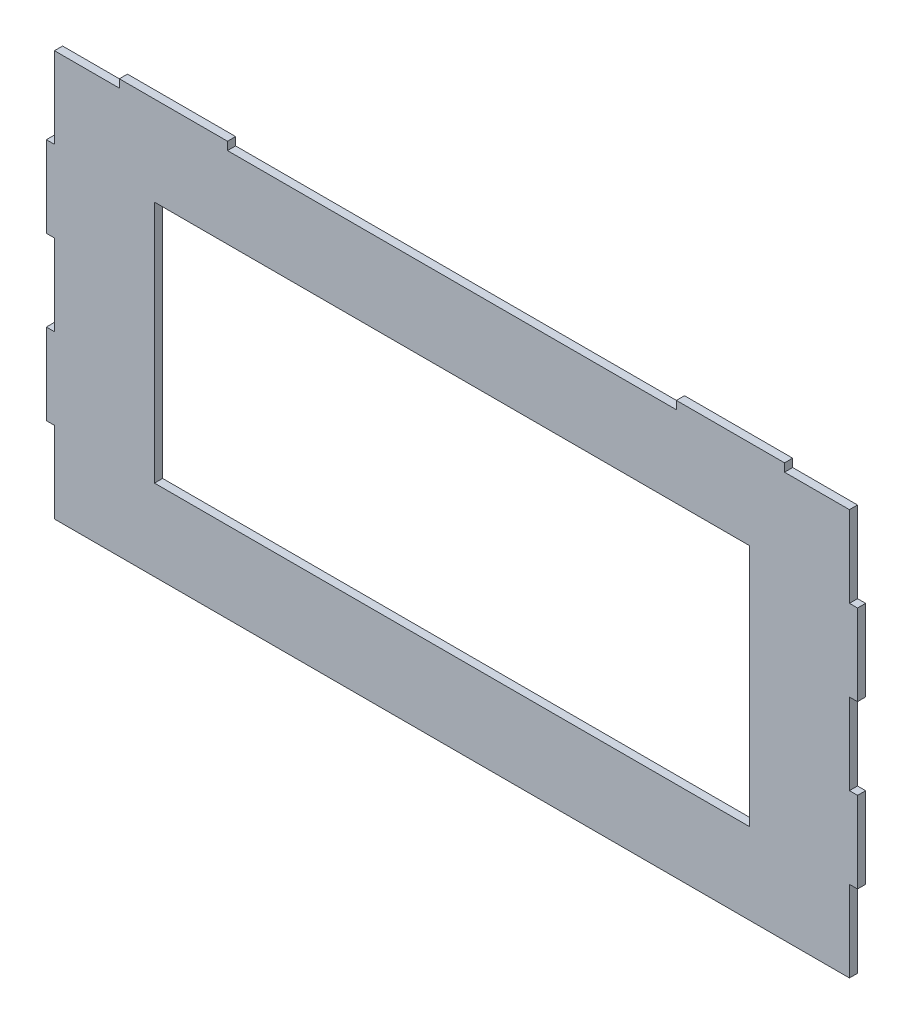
from build123d import *

# Parameters (mm, degrees)
CROQUIS1_W              = 294
CROQUIS1_H              = 150
CROQUIS1_W_2            = 220
CROQUIS1_H_2            = 90
SALIENTE_EXTRUIR1_DEPTH = 3
CROQUIS2_W              = 40
CROQUIS2_H              = 3
SALIENTE_EXTRUIR2_DEPTH = 3
CROQUIS3_W              = 3
CROQUIS3_H              = 30
SALIENTE_EXTRUIR3_DEPTH = 3
CROQUIS4_W              = 3
CROQUIS4_H              = 30
SALIENTE_EXTRUIR4_DEPTH = 3


with BuildPart() as part:
    # Croquis1 → Saliente-Extruir1 (new body)
    with BuildSketch(Plane.XY):
        Rectangle(CROQUIS1_W, CROQUIS1_H)
        Rectangle(CROQUIS1_W_2, CROQUIS1_H_2, mode=Mode.SUBTRACT)
    extrude(amount=SALIENTE_EXTRUIR1_DEPTH)

    # Croquis2 → Saliente-Extruir2 (add)
    with BuildSketch(Plane(origin=(0, 75, 0), x_dir=(1, 0, 0), z_dir=(0, 1, 0))):
        with Locations((-103, -1.5)):
            Rectangle(CROQUIS2_W, CROQUIS2_H)
        with Locations((103, -1.5)):
            Rectangle(CROQUIS2_W, CROQUIS2_H)
    extrude(amount=SALIENTE_EXTRUIR2_DEPTH)

    # Croquis3 → Saliente-Extruir3 (add)
    with BuildSketch(Plane(origin=(147, 0, 0), x_dir=(0, 0, -1), z_dir=(1, 0, 0))):
        with Locations((-1.5, 30)):
            Rectangle(CROQUIS3_W, CROQUIS3_H)
        with Locations((-1.5, -30)):
            Rectangle(CROQUIS3_W, CROQUIS3_H)
    extrude(amount=SALIENTE_EXTRUIR3_DEPTH)

    # Croquis4 → Saliente-Extruir4 (add)
    with BuildSketch(Plane.ZY.offset(147)):
        with Locations((1.5, 30)):
            Rectangle(CROQUIS4_W, CROQUIS4_H)
        with Locations((1.5, -30)):
            Rectangle(CROQUIS4_W, CROQUIS4_H)
    extrude(amount=SALIENTE_EXTRUIR4_DEPTH)


solid = part.part
